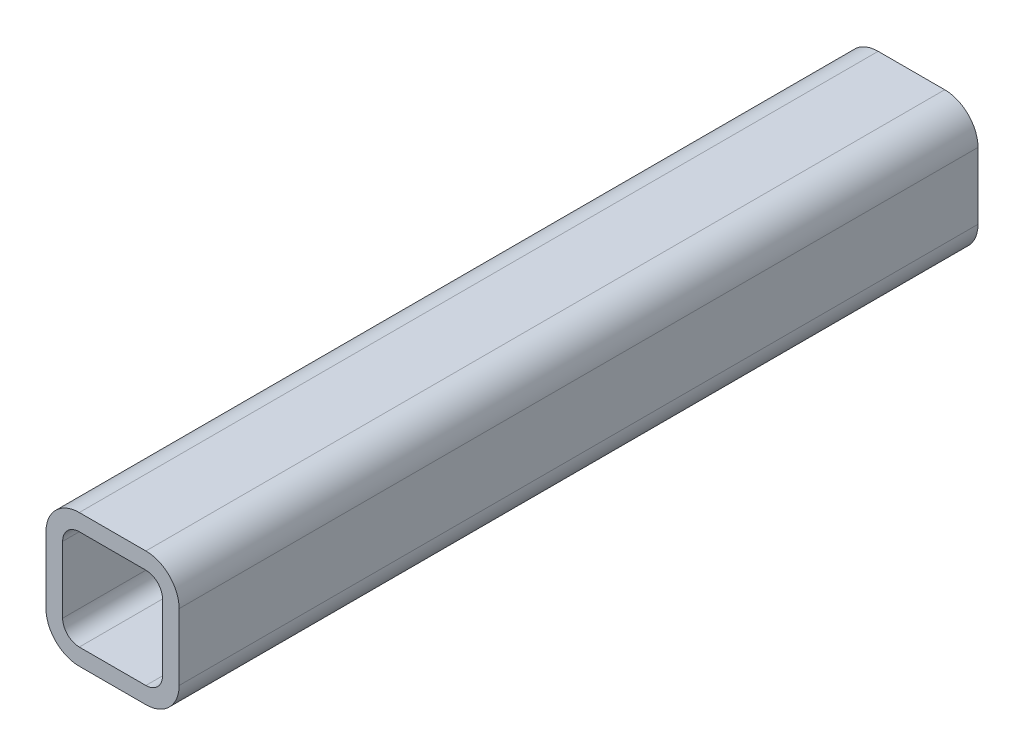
from build123d import *

# Parameters (mm, degrees)
BOSS_EXTRUDE1_DEPTH = 304.8


with BuildPart() as part:
    # Sketch1 → Boss-Extrude1 (new body)
    with BuildSketch(Plane.XY):
        with BuildLine():
            Line((-1.277936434, 35.375057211), (-1.277936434, 9.975057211))
            ThreePointArc((-1.277936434, 9.975057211), (2.441807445, 0.99480109), (11.422063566, -2.724942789))
            Line((11.422063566, -2.724942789), (36.822063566, -2.724942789))
            ThreePointArc((36.822063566, -2.724942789), (45.802319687, 0.99480109), (49.522063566, 9.975057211))
            Line((49.522063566, 9.975057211), (49.522063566, 35.375057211))
            ThreePointArc((49.522063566, 35.375057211), (45.802319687, 44.355313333), (36.822063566, 48.075057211))
            Line((36.822063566, 48.075057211), (11.422063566, 48.075057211))
            ThreePointArc((11.422063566, 48.075057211), (2.441807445, 44.355313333), (-1.277936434, 35.375057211))
        make_face()
        with BuildLine():
            Line((5.072063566, 9.975057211), (5.072063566, 35.375057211))
            ThreePointArc((5.072063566, 35.375057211), (6.931935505, 39.865185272), (11.422063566, 41.725057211))
            Line((11.422063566, 41.725057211), (36.822063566, 41.725057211))
            ThreePointArc((36.822063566, 41.725057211), (41.312191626, 39.865185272), (43.172063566, 35.375057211))
            Line((43.172063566, 35.375057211), (43.172063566, 9.975057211))
            ThreePointArc((43.172063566, 9.975057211), (41.312191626, 5.484929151), (36.822063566, 3.625057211))
            Line((36.822063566, 3.625057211), (11.422063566, 3.625057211))
            ThreePointArc((11.422063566, 3.625057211), (6.931935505, 5.484929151), (5.072063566, 9.975057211))
        make_face(mode=Mode.SUBTRACT)
    extrude(amount=BOSS_EXTRUDE1_DEPTH)


solid = part.part
